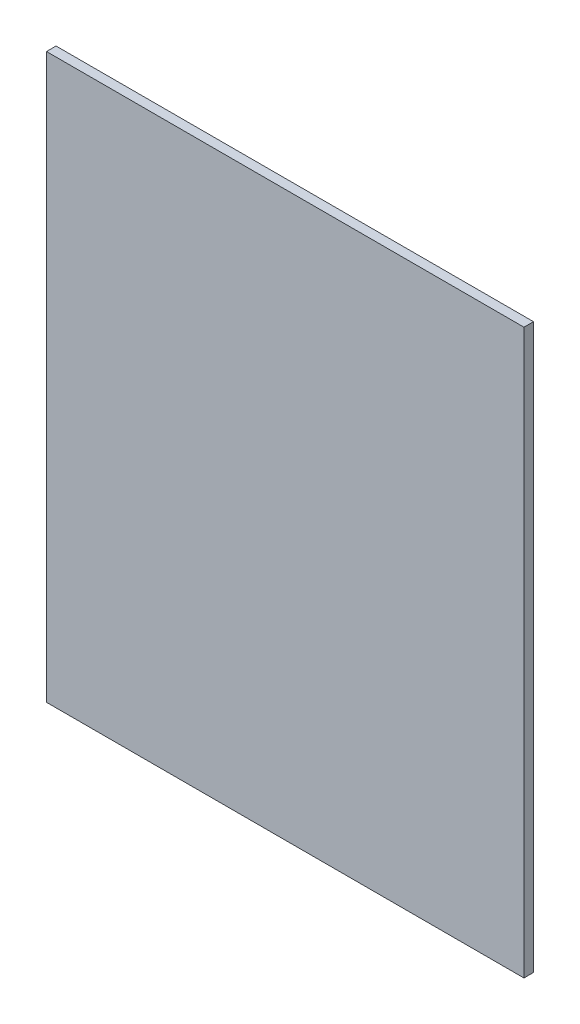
ISO-10303-21;
HEADER;
FILE_DESCRIPTION(('STEP AP214'),'2;1');
FILE_NAME('part.step','',(''),(''),'','','');
FILE_SCHEMA(('AUTOMOTIVE_DESIGN { 1 0 10303 214 1 1 1 1 }'));
ENDSEC;
DATA;
#1=APPLICATION_CONTEXT('core data for automotive mechanical design processes');
#2=APPLICATION_PROTOCOL_DEFINITION('international standard','automotive_design',2000,#1);
#3=PRODUCT_CONTEXT('',#1,'mechanical');
#4=PRODUCT('Part','Part','',(#3));
#5=PRODUCT_RELATED_PRODUCT_CATEGORY('part','',(#4));
#6=PRODUCT_DEFINITION_FORMATION('','',#4);
#7=PRODUCT_DEFINITION_CONTEXT('part definition',#1,'design');
#8=PRODUCT_DEFINITION('design','',#6,#7);
#9=PRODUCT_DEFINITION_SHAPE('','',#8);
#10=(LENGTH_UNIT() NAMED_UNIT(*) SI_UNIT(.MILLI.,.METRE.));
#11=(NAMED_UNIT(*) PLANE_ANGLE_UNIT() SI_UNIT($,.RADIAN.));
#12=(NAMED_UNIT(*) SI_UNIT($,.STERADIAN.) SOLID_ANGLE_UNIT());
#13=UNCERTAINTY_MEASURE_WITH_UNIT(LENGTH_MEASURE(1.E-05),#10,'distance_accuracy_value','');
#14=(GEOMETRIC_REPRESENTATION_CONTEXT(3) GLOBAL_UNCERTAINTY_ASSIGNED_CONTEXT((#13)) GLOBAL_UNIT_ASSIGNED_CONTEXT((#10,
#11,#12)) REPRESENTATION_CONTEXT('',''));
#15=CARTESIAN_POINT('',(0.,0.,0.));
#16=DIRECTION('',(0.,0.,1.));
#17=DIRECTION('',(1.,0.,0.));
#18=AXIS2_PLACEMENT_3D('',#15,#16,#17);
#19=CARTESIAN_POINT('',(-580.298492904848,590.213783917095,-10.));
#20=DIRECTION('',(0.,0.,1.));
#21=DIRECTION('',(0.,-1.,0.));
#22=AXIS2_PLACEMENT_3D('',#19,#20,#21);
#23=PLANE('',#22);
#24=DIRECTION('',(0.,-1.,0.));
#25=VECTOR('',#24,1.);
#26=CARTESIAN_POINT('',(10.,590.213783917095,-10.));
#27=LINE('',#26,#25);
#28=CARTESIAN_POINT('',(10.,590.213783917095,-10.));
#29=VERTEX_POINT('',#28);
#30=CARTESIAN_POINT('',(10.,0.,-9.9999999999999));
#31=VERTEX_POINT('',#30);
#32=EDGE_CURVE('E41',#29,#31,#27,.T.);
#33=ORIENTED_EDGE('',*,*,#32,.F.);
#34=DIRECTION('',(1.,0.,0.));
#35=VECTOR('',#34,1.);
#36=CARTESIAN_POINT('',(-580.298492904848,590.213783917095,-10.));
#37=LINE('',#36,#35);
#38=CARTESIAN_POINT('',(510.,590.213783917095,-10.));
#39=VERTEX_POINT('',#38);
#40=EDGE_CURVE('E90',#29,#39,#37,.T.);
#41=ORIENTED_EDGE('',*,*,#40,.T.);
#42=DIRECTION('',(0.,-1.,0.));
#43=VECTOR('',#42,1.);
#44=CARTESIAN_POINT('',(510.,590.213783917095,-10.));
#45=LINE('',#44,#43);
#46=CARTESIAN_POINT('',(510.,0.,-9.99999999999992));
#47=VERTEX_POINT('',#46);
#48=EDGE_CURVE('E85',#39,#47,#45,.T.);
#49=ORIENTED_EDGE('',*,*,#48,.T.);
#50=DIRECTION('',(1.,0.,0.));
#51=VECTOR('',#50,1.);
#52=CARTESIAN_POINT('',(-580.298492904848,0.,-9.99999999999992));
#53=LINE('',#52,#51);
#54=EDGE_CURVE('E70',#31,#47,#53,.T.);
#55=ORIENTED_EDGE('',*,*,#54,.F.);
#56=EDGE_LOOP('',(#33,#41,#49,#55));
#57=FACE_BOUND('',#56,.T.);
#58=ADVANCED_FACE('F33',(#57),#23,.F.);
#59=CARTESIAN_POINT('',(-580.298492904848,0.,-9.99999999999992));
#60=DIRECTION('',(0.,1.,0.));
#61=DIRECTION('',(0.,0.,1.));
#62=AXIS2_PLACEMENT_3D('',#59,#60,#61);
#63=PLANE('',#62);
#64=DIRECTION('',(0.,0.,1.));
#65=VECTOR('',#64,1.);
#66=CARTESIAN_POINT('',(10.,0.,-9.99999999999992));
#67=LINE('',#66,#65);
#68=CARTESIAN_POINT('',(10.,0.,0.));
#69=VERTEX_POINT('',#68);
#70=EDGE_CURVE('E36',#31,#69,#67,.T.);
#71=ORIENTED_EDGE('',*,*,#70,.F.);
#72=ORIENTED_EDGE('',*,*,#54,.T.);
#73=DIRECTION('',(0.,0.,1.));
#74=VECTOR('',#73,1.);
#75=CARTESIAN_POINT('',(510.,0.,-9.99999999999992));
#76=LINE('',#75,#74);
#77=CARTESIAN_POINT('',(510.,0.,0.));
#78=VERTEX_POINT('',#77);
#79=EDGE_CURVE('E74',#47,#78,#76,.T.);
#80=ORIENTED_EDGE('',*,*,#79,.T.);
#81=DIRECTION('',(1.,0.,0.));
#82=VECTOR('',#81,1.);
#83=CARTESIAN_POINT('',(-580.298492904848,0.,0.));
#84=LINE('',#83,#82);
#85=EDGE_CURVE('E79',#69,#78,#84,.T.);
#86=ORIENTED_EDGE('',*,*,#85,.F.);
#87=EDGE_LOOP('',(#71,#72,#80,#86));
#88=FACE_BOUND('',#87,.T.);
#89=ADVANCED_FACE('F72',(#88),#63,.F.);
#90=CARTESIAN_POINT('',(-580.298492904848,590.213783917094,0.));
#91=DIRECTION('',(0.,0.,-1.));
#92=DIRECTION('',(-1.,0.,0.));
#93=AXIS2_PLACEMENT_3D('',#90,#91,#92);
#94=PLANE('',#93);
#95=DIRECTION('',(0.,1.,0.));
#96=VECTOR('',#95,1.);
#97=CARTESIAN_POINT('',(10.,590.213783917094,0.));
#98=LINE('',#97,#96);
#99=CARTESIAN_POINT('',(10.,590.213783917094,0.));
#100=VERTEX_POINT('',#99);
#101=EDGE_CURVE('E78',#69,#100,#98,.T.);
#102=ORIENTED_EDGE('',*,*,#101,.F.);
#103=ORIENTED_EDGE('',*,*,#85,.T.);
#104=DIRECTION('',(0.,1.,0.));
#105=VECTOR('',#104,1.);
#106=CARTESIAN_POINT('',(510.,590.213783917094,0.));
#107=LINE('',#106,#105);
#108=CARTESIAN_POINT('',(510.,590.213783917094,0.));
#109=VERTEX_POINT('',#108);
#110=EDGE_CURVE('E87',#78,#109,#107,.T.);
#111=ORIENTED_EDGE('',*,*,#110,.T.);
#112=DIRECTION('',(1.,0.,0.));
#113=VECTOR('',#112,1.);
#114=CARTESIAN_POINT('',(-580.298492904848,590.213783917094,0.));
#115=LINE('',#114,#113);
#116=EDGE_CURVE('E99',#100,#109,#115,.T.);
#117=ORIENTED_EDGE('',*,*,#116,.F.);
#118=EDGE_LOOP('',(#102,#103,#111,#117));
#119=FACE_BOUND('',#118,.T.);
#120=ADVANCED_FACE('F105',(#119),#94,.F.);
#121=CARTESIAN_POINT('',(-580.298492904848,590.213783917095,-10.));
#122=DIRECTION('',(0.,-1.,0.));
#123=DIRECTION('',(0.,0.,-1.));
#124=AXIS2_PLACEMENT_3D('',#121,#122,#123);
#125=PLANE('',#124);
#126=DIRECTION('',(0.,0.,-1.));
#127=VECTOR('',#126,1.);
#128=CARTESIAN_POINT('',(10.,590.213783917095,-10.));
#129=LINE('',#128,#127);
#130=EDGE_CURVE('E11',#100,#29,#129,.T.);
#131=ORIENTED_EDGE('',*,*,#130,.F.);
#132=ORIENTED_EDGE('',*,*,#116,.T.);
#133=DIRECTION('',(0.,0.,-1.));
#134=VECTOR('',#133,1.);
#135=CARTESIAN_POINT('',(510.,590.213783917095,-10.));
#136=LINE('',#135,#134);
#137=EDGE_CURVE('E96',#109,#39,#136,.T.);
#138=ORIENTED_EDGE('',*,*,#137,.T.);
#139=ORIENTED_EDGE('',*,*,#40,.F.);
#140=EDGE_LOOP('',(#131,#132,#138,#139));
#141=FACE_BOUND('',#140,.T.);
#142=ADVANCED_FACE('F107',(#141),#125,.F.);
#143=CARTESIAN_POINT('',(510.,0.,0.));
#144=DIRECTION('',(-1.,0.,0.));
#145=DIRECTION('',(0.,0.,1.));
#146=AXIS2_PLACEMENT_3D('',#143,#144,#145);
#147=PLANE('',#146);
#148=ORIENTED_EDGE('',*,*,#48,.F.);
#149=ORIENTED_EDGE('',*,*,#137,.F.);
#150=ORIENTED_EDGE('',*,*,#110,.F.);
#151=ORIENTED_EDGE('',*,*,#79,.F.);
#152=EDGE_LOOP('',(#148,#149,#150,#151));
#153=FACE_BOUND('',#152,.T.);
#154=ADVANCED_FACE('F83',(#153),#147,.F.);
#155=CARTESIAN_POINT('',(10.,648.878970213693,-164.822751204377));
#156=DIRECTION('',(-1.,0.,0.));
#157=DIRECTION('',(0.,0.,1.));
#158=AXIS2_PLACEMENT_3D('',#155,#156,#157);
#159=PLANE('',#158);
#160=ORIENTED_EDGE('',*,*,#32,.T.);
#161=ORIENTED_EDGE('',*,*,#70,.T.);
#162=ORIENTED_EDGE('',*,*,#101,.T.);
#163=ORIENTED_EDGE('',*,*,#130,.T.);
#164=EDGE_LOOP('',(#160,#161,#162,#163));
#165=FACE_BOUND('',#164,.T.);
#166=ADVANCED_FACE('F102',(#165),#159,.T.);
#167=CLOSED_SHELL('',(#58,#89,#120,#142,#154,#166));
#168=MANIFOLD_SOLID_BREP('B2',#167);
#169=ADVANCED_BREP_SHAPE_REPRESENTATION('',(#18,#168),#14);
#170=SHAPE_DEFINITION_REPRESENTATION(#9,#169);
ENDSEC;
END-ISO-10303-21;
